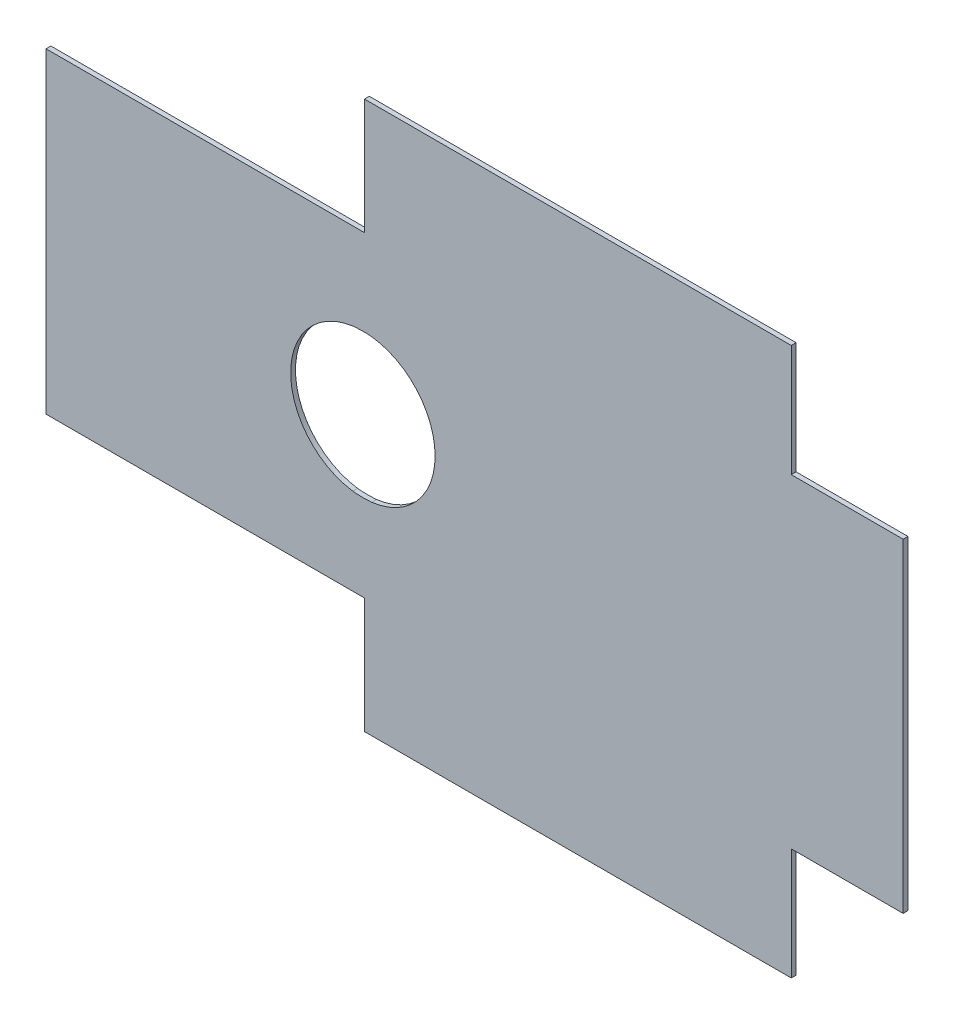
ISO-10303-21;
HEADER;
FILE_DESCRIPTION(('STEP AP214'),'2;1');
FILE_NAME('part.step','',(''),(''),'','','');
FILE_SCHEMA(('AUTOMOTIVE_DESIGN { 1 0 10303 214 1 1 1 1 }'));
ENDSEC;
DATA;
#1=APPLICATION_CONTEXT('core data for automotive mechanical design processes');
#2=APPLICATION_PROTOCOL_DEFINITION('international standard','automotive_design',2000,#1);
#3=PRODUCT_CONTEXT('',#1,'mechanical');
#4=PRODUCT('Part','Part','',(#3));
#5=PRODUCT_RELATED_PRODUCT_CATEGORY('part','',(#4));
#6=PRODUCT_DEFINITION_FORMATION('','',#4);
#7=PRODUCT_DEFINITION_CONTEXT('part definition',#1,'design');
#8=PRODUCT_DEFINITION('design','',#6,#7);
#9=PRODUCT_DEFINITION_SHAPE('','',#8);
#10=(LENGTH_UNIT() NAMED_UNIT(*) SI_UNIT(.MILLI.,.METRE.));
#11=(NAMED_UNIT(*) PLANE_ANGLE_UNIT() SI_UNIT($,.RADIAN.));
#12=(NAMED_UNIT(*) SI_UNIT($,.STERADIAN.) SOLID_ANGLE_UNIT());
#13=UNCERTAINTY_MEASURE_WITH_UNIT(LENGTH_MEASURE(1.E-05),#10,'distance_accuracy_value','');
#14=(GEOMETRIC_REPRESENTATION_CONTEXT(3) GLOBAL_UNCERTAINTY_ASSIGNED_CONTEXT((#13)) GLOBAL_UNIT_ASSIGNED_CONTEXT((#10,
#11,#12)) REPRESENTATION_CONTEXT('',''));
#15=CARTESIAN_POINT('',(0.,0.,0.));
#16=DIRECTION('',(0.,0.,1.));
#17=DIRECTION('',(1.,0.,0.));
#18=AXIS2_PLACEMENT_3D('',#15,#16,#17);
#19=CARTESIAN_POINT('',(-43.1719319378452,32.8600250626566,-1.00000000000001));
#20=DIRECTION('',(0.,1.,0.));
#21=DIRECTION('',(0.,0.,1.));
#22=AXIS2_PLACEMENT_3D('',#19,#20,#21);
#23=PLANE('',#22);
#24=DIRECTION('',(-1.,0.,0.));
#25=VECTOR('',#24,1.);
#26=CARTESIAN_POINT('',(-44.6719319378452,32.8600250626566,-1.00000000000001));
#27=LINE('',#26,#25);
#28=CARTESIAN_POINT('',(-43.1719319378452,32.8600250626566,-1.00000000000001));
#29=VERTEX_POINT('',#28);
#30=CARTESIAN_POINT('',(-44.6719319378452,32.8600250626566,-1.00000000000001));
#31=VERTEX_POINT('',#30);
#32=EDGE_CURVE('E458',#29,#31,#27,.T.);
#33=ORIENTED_EDGE('',*,*,#32,.F.);
#34=DIRECTION('',(0.,0.,-1.));
#35=VECTOR('',#34,1.);
#36=CARTESIAN_POINT('',(-43.1719319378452,32.8600250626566,0.));
#37=LINE('',#36,#35);
#38=CARTESIAN_POINT('',(-43.1719319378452,32.8600250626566,0.));
#39=VERTEX_POINT('',#38);
#40=EDGE_CURVE('E482',#39,#29,#37,.T.);
#41=ORIENTED_EDGE('',*,*,#40,.F.);
#42=DIRECTION('',(1.,0.,0.));
#43=VECTOR('',#42,1.);
#44=CARTESIAN_POINT('',(-44.6719319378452,32.8600250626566,0.));
#45=LINE('',#44,#43);
#46=CARTESIAN_POINT('',(-44.6719319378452,32.8600250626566,0.));
#47=VERTEX_POINT('',#46);
#48=EDGE_CURVE('E13',#47,#39,#45,.T.);
#49=ORIENTED_EDGE('',*,*,#48,.F.);
#50=DIRECTION('',(0.,0.,-1.));
#51=VECTOR('',#50,1.);
#52=CARTESIAN_POINT('',(-44.6719319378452,32.8600250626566,-1.00000000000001));
#53=LINE('',#52,#51);
#54=EDGE_CURVE('E198',#47,#31,#53,.T.);
#55=ORIENTED_EDGE('',*,*,#54,.T.);
#56=EDGE_LOOP('',(#33,#41,#49,#55));
#57=FACE_BOUND('',#56,.T.);
#58=ADVANCED_FACE('F190',(#57),#23,.F.);
#59=CARTESIAN_POINT('',(-43.1719319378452,-32.8600250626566,-1.));
#60=DIRECTION('',(0.,1.,0.));
#61=DIRECTION('',(0.,0.,1.));
#62=AXIS2_PLACEMENT_3D('',#59,#60,#61);
#63=PLANE('',#62);
#64=DIRECTION('',(0.,0.,-1.));
#65=VECTOR('',#64,1.);
#66=CARTESIAN_POINT('',(-44.6719319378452,-32.8600250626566,-1.));
#67=LINE('',#66,#65);
#68=CARTESIAN_POINT('',(-44.6719319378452,-32.8600250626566,0.));
#69=VERTEX_POINT('',#68);
#70=CARTESIAN_POINT('',(-44.6719319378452,-32.8600250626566,-1.));
#71=VERTEX_POINT('',#70);
#72=EDGE_CURVE('E209',#69,#71,#67,.T.);
#73=ORIENTED_EDGE('',*,*,#72,.F.);
#74=DIRECTION('',(1.,0.,0.));
#75=VECTOR('',#74,1.);
#76=CARTESIAN_POINT('',(-44.6719319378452,-32.8600250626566,0.));
#77=LINE('',#76,#75);
#78=CARTESIAN_POINT('',(-43.1719319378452,-32.8600250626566,0.));
#79=VERTEX_POINT('',#78);
#80=EDGE_CURVE('E485',#69,#79,#77,.T.);
#81=ORIENTED_EDGE('',*,*,#80,.T.);
#82=DIRECTION('',(0.,0.,-1.));
#83=VECTOR('',#82,1.);
#84=CARTESIAN_POINT('',(-43.1719319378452,-32.8600250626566,0.));
#85=LINE('',#84,#83);
#86=CARTESIAN_POINT('',(-43.1719319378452,-32.8600250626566,-0.999999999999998));
#87=VERTEX_POINT('',#86);
#88=EDGE_CURVE('E493',#79,#87,#85,.T.);
#89=ORIENTED_EDGE('',*,*,#88,.T.);
#90=DIRECTION('',(1.,0.,0.));
#91=VECTOR('',#90,1.);
#92=CARTESIAN_POINT('',(43.1719319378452,-32.8600250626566,-0.999999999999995));
#93=LINE('',#92,#91);
#94=EDGE_CURVE('E205',#71,#87,#93,.T.);
#95=ORIENTED_EDGE('',*,*,#94,.F.);
#96=EDGE_LOOP('',(#73,#81,#89,#95));
#97=FACE_BOUND('',#96,.T.);
#98=ADVANCED_FACE('F577',(#97),#63,.T.);
#99=CARTESIAN_POINT('',(44.6719319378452,34.3600250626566,-1.));
#100=DIRECTION('',(0.,0.,-1.));
#101=DIRECTION('',(-1.,0.,0.));
#102=AXIS2_PLACEMENT_3D('',#99,#100,#101);
#103=PLANE('',#102);
#104=CARTESIAN_POINT('',(-45.,0.,-1.00000000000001));
#105=DIRECTION('',(0.,0.,1.));
#106=DIRECTION('',(1.,0.,0.));
#107=AXIS2_PLACEMENT_3D('',#104,#105,#106);
#108=CIRCLE('',#107,15.);
#109=CARTESIAN_POINT('',(-47.0989227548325,14.8524248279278,-1.00000000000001));
#110=VERTEX_POINT('',#109);
#111=CARTESIAN_POINT('',(-47.0989227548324,-14.8524248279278,-1.00000000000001));
#112=VERTEX_POINT('',#111);
#113=EDGE_CURVE('E591',#110,#112,#108,.T.);
#114=ORIENTED_EDGE('',*,*,#113,.T.);
#115=CARTESIAN_POINT('',(-43.1719319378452,-14.8881888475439,-1.));
#116=CARTESIAN_POINT('',(-44.984497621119,-15.0503119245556,-1.));
#117=CARTESIAN_POINT('',(-47.0989227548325,-14.8524248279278,-1.));
#118=B_SPLINE_CURVE_WITH_KNOTS('',2,(#115,#116,#117),.UNSPECIFIED.,.F.,.F.,(3,3),(0.,1.),.UNSPECIFIED.);
#119=CARTESIAN_POINT('',(-43.1719319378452,-14.8881888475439,-1.));
#120=VERTEX_POINT('',#119);
#121=EDGE_CURVE('E443',#120,#112,#118,.T.);
#122=ORIENTED_EDGE('',*,*,#121,.F.);
#123=CARTESIAN_POINT('',(-45.,0.,-1.));
#124=DIRECTION('',(0.,0.,1.));
#125=DIRECTION('',(1.,0.,0.));
#126=AXIS2_PLACEMENT_3D('',#123,#124,#125);
#127=CIRCLE('',#126,15.);
#128=CARTESIAN_POINT('',(-43.1719319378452,14.8881888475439,-1.));
#129=VERTEX_POINT('',#128);
#130=EDGE_CURVE('E557',#120,#129,#127,.T.);
#131=ORIENTED_EDGE('',*,*,#130,.T.);
#132=CARTESIAN_POINT('',(-47.0989227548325,14.8524248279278,-1.00000000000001));
#133=CARTESIAN_POINT('',(-45.2797906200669,15.0474018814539,-1.00000000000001));
#134=CARTESIAN_POINT('',(-43.1719319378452,14.8881888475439,-1.00000000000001));
#135=B_SPLINE_CURVE_WITH_KNOTS('',2,(#132,#133,#134),.UNSPECIFIED.,.F.,.F.,(3,3),(0.,1.),.UNSPECIFIED.);
#136=EDGE_CURVE('E479',#110,#129,#135,.T.);
#137=ORIENTED_EDGE('',*,*,#136,.F.);
#138=EDGE_LOOP('',(#114,#122,#131,#137));
#139=FACE_BOUND('',#138,.T.);
#140=DIRECTION('',(-1.,0.,0.));
#141=VECTOR('',#140,1.);
#142=CARTESIAN_POINT('',(-45.1354273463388,-32.8600250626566,-1.));
#143=LINE('',#142,#141);
#144=CARTESIAN_POINT('',(-110.798922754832,-32.8600250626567,-1.00000000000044));
#145=VERTEX_POINT('',#144);
#146=EDGE_CURVE('E448',#145,#87,#143,.F.);
#147=ORIENTED_EDGE('',*,*,#146,.F.);
#148=DIRECTION('',(0.,1.,0.));
#149=VECTOR('',#148,1.);
#150=CARTESIAN_POINT('',(-110.798922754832,32.8600250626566,-1.00000000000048));
#151=LINE('',#150,#149);
#152=CARTESIAN_POINT('',(-110.798922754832,32.8600250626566,-1.00000000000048));
#153=VERTEX_POINT('',#152);
#154=EDGE_CURVE('E475',#145,#153,#151,.T.);
#155=ORIENTED_EDGE('',*,*,#154,.T.);
#156=DIRECTION('',(-1.,0.,0.));
#157=VECTOR('',#156,1.);
#158=CARTESIAN_POINT('',(-45.1354273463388,32.8600250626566,-1.00000000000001));
#159=LINE('',#158,#157);
#160=EDGE_CURVE('E472',#29,#153,#159,.T.);
#161=ORIENTED_EDGE('',*,*,#160,.F.);
#162=ORIENTED_EDGE('',*,*,#32,.T.);
#163=DIRECTION('',(0.,1.,0.));
#164=VECTOR('',#163,1.);
#165=CARTESIAN_POINT('',(-44.6719319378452,34.8235204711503,-1.00000000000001));
#166=LINE('',#165,#164);
#167=CARTESIAN_POINT('',(-44.6719319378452,56.8870158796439,-1.00000000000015));
#168=VERTEX_POINT('',#167);
#169=EDGE_CURVE('E358',#168,#31,#166,.F.);
#170=ORIENTED_EDGE('',*,*,#169,.F.);
#171=DIRECTION('',(1.,0.,0.));
#172=VECTOR('',#171,1.);
#173=CARTESIAN_POINT('',(44.6719319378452,56.8870158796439,-1.00000000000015));
#174=LINE('',#173,#172);
#175=CARTESIAN_POINT('',(43.9648251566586,56.8870158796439,-1.00000000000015));
#176=VERTEX_POINT('',#175);
#177=EDGE_CURVE('E325',#168,#176,#174,.T.);
#178=ORIENTED_EDGE('',*,*,#177,.T.);
#179=DIRECTION('',(0.,1.,0.));
#180=VECTOR('',#179,1.);
#181=CARTESIAN_POINT('',(43.9648251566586,56.8870158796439,-1.00000000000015));
#182=LINE('',#181,#180);
#183=CARTESIAN_POINT('',(43.9648251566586,33.6529182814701,-0.99999999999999));
#184=VERTEX_POINT('',#183);
#185=EDGE_CURVE('E324',#184,#176,#182,.T.);
#186=ORIENTED_EDGE('',*,*,#185,.F.);
#187=DIRECTION('',(1.,0.,0.));
#188=VECTOR('',#187,1.);
#189=CARTESIAN_POINT('',(67.1989227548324,33.6529182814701,-1.00000000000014));
#190=LINE('',#189,#188);
#191=CARTESIAN_POINT('',(67.1989227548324,33.6529182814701,-1.00000000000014));
#192=VERTEX_POINT('',#191);
#193=EDGE_CURVE('E342',#184,#192,#190,.T.);
#194=ORIENTED_EDGE('',*,*,#193,.T.);
#195=DIRECTION('',(0.,-1.,0.));
#196=VECTOR('',#195,1.);
#197=CARTESIAN_POINT('',(67.1989227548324,-34.3600250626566,-1.00000000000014));
#198=LINE('',#197,#196);
#199=CARTESIAN_POINT('',(67.1989227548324,-33.6529182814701,-1.00000000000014));
#200=VERTEX_POINT('',#199);
#201=EDGE_CURVE('E338',#192,#200,#198,.T.);
#202=ORIENTED_EDGE('',*,*,#201,.T.);
#203=DIRECTION('',(1.,0.,0.));
#204=VECTOR('',#203,1.);
#205=CARTESIAN_POINT('',(67.1989227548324,-33.6529182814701,-1.00000000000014));
#206=LINE('',#205,#204);
#207=CARTESIAN_POINT('',(43.9648251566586,-33.6529182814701,-0.999999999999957));
#208=VERTEX_POINT('',#207);
#209=EDGE_CURVE('E368',#208,#200,#206,.T.);
#210=ORIENTED_EDGE('',*,*,#209,.F.);
#211=DIRECTION('',(0.,-1.,0.));
#212=VECTOR('',#211,1.);
#213=CARTESIAN_POINT('',(43.9648251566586,-56.8870158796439,-1.00000000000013));
#214=LINE('',#213,#212);
#215=CARTESIAN_POINT('',(43.9648251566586,-56.8870158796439,-1.00000000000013));
#216=VERTEX_POINT('',#215);
#217=EDGE_CURVE('E388',#208,#216,#214,.T.);
#218=ORIENTED_EDGE('',*,*,#217,.T.);
#219=DIRECTION('',(-1.,0.,0.));
#220=VECTOR('',#219,1.);
#221=CARTESIAN_POINT('',(-44.6719319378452,-56.8870158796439,-1.00000000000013));
#222=LINE('',#221,#220);
#223=CARTESIAN_POINT('',(-44.6719319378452,-56.8870158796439,-1.00000000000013));
#224=VERTEX_POINT('',#223);
#225=EDGE_CURVE('E385',#216,#224,#222,.T.);
#226=ORIENTED_EDGE('',*,*,#225,.T.);
#227=DIRECTION('',(0.,1.,0.));
#228=VECTOR('',#227,1.);
#229=CARTESIAN_POINT('',(-44.6719319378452,-34.8235204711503,-0.999999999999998));
#230=LINE('',#229,#228);
#231=EDGE_CURVE('E394',#71,#224,#230,.F.);
#232=ORIENTED_EDGE('',*,*,#231,.F.);
#233=ORIENTED_EDGE('',*,*,#94,.T.);
#234=EDGE_LOOP('',(#147,#155,#161,#162,#170,#178,#186,#194,#202,#210,#218,#226,#232,#233));
#235=FACE_BOUND('',#234,.T.);
#236=ADVANCED_FACE('F192',(#139,#235),#103,.T.);
#237=CARTESIAN_POINT('',(44.6719319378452,34.3600250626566,0.));
#238=DIRECTION('',(0.,0.,-1.));
#239=DIRECTION('',(-1.,0.,0.));
#240=AXIS2_PLACEMENT_3D('',#237,#238,#239);
#241=PLANE('',#240);
#242=DIRECTION('',(0.,1.,0.));
#243=VECTOR('',#242,1.);
#244=CARTESIAN_POINT('',(-110.798922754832,32.8600250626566,-4.78783679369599E-13));
#245=LINE('',#244,#243);
#246=CARTESIAN_POINT('',(-110.798922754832,-32.8600250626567,-4.44089209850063E-13));
#247=VERTEX_POINT('',#246);
#248=CARTESIAN_POINT('',(-110.798922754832,32.8600250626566,-4.78783679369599E-13));
#249=VERTEX_POINT('',#248);
#250=EDGE_CURVE('E878',#247,#249,#245,.T.);
#251=ORIENTED_EDGE('',*,*,#250,.F.);
#252=DIRECTION('',(-1.,0.,0.));
#253=VECTOR('',#252,1.);
#254=CARTESIAN_POINT('',(-45.1354273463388,-32.8600250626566,0.));
#255=LINE('',#254,#253);
#256=EDGE_CURVE('E449',#247,#79,#255,.F.);
#257=ORIENTED_EDGE('',*,*,#256,.T.);
#258=ORIENTED_EDGE('',*,*,#80,.F.);
#259=DIRECTION('',(0.,1.,0.));
#260=VECTOR('',#259,1.);
#261=CARTESIAN_POINT('',(-44.6719319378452,-34.8235204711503,0.));
#262=LINE('',#261,#260);
#263=CARTESIAN_POINT('',(-44.6719319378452,-56.8870158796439,-1.31838984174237E-13));
#264=VERTEX_POINT('',#263);
#265=EDGE_CURVE('E381',#69,#264,#262,.F.);
#266=ORIENTED_EDGE('',*,*,#265,.T.);
#267=DIRECTION('',(-1.,0.,0.));
#268=VECTOR('',#267,1.);
#269=CARTESIAN_POINT('',(-44.6719319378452,-56.8870158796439,-1.31838984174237E-13));
#270=LINE('',#269,#268);
#271=CARTESIAN_POINT('',(43.9648251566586,-56.8870158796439,-1.31838984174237E-13));
#272=VERTEX_POINT('',#271);
#273=EDGE_CURVE('E390',#272,#264,#270,.T.);
#274=ORIENTED_EDGE('',*,*,#273,.F.);
#275=DIRECTION('',(0.,-1.,0.));
#276=VECTOR('',#275,1.);
#277=CARTESIAN_POINT('',(43.9648251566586,-35.2870158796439,0.));
#278=LINE('',#277,#276);
#279=CARTESIAN_POINT('',(43.9648251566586,-33.6529182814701,0.));
#280=VERTEX_POINT('',#279);
#281=EDGE_CURVE('E382',#280,#272,#278,.T.);
#282=ORIENTED_EDGE('',*,*,#281,.F.);
#283=DIRECTION('',(1.,0.,0.));
#284=VECTOR('',#283,1.);
#285=CARTESIAN_POINT('',(45.5989227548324,-33.6529182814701,0.));
#286=LINE('',#285,#284);
#287=CARTESIAN_POINT('',(67.1989227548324,-33.6529182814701,0.));
#288=VERTEX_POINT('',#287);
#289=EDGE_CURVE('E337',#280,#288,#286,.T.);
#290=ORIENTED_EDGE('',*,*,#289,.T.);
#291=DIRECTION('',(0.,-1.,0.));
#292=VECTOR('',#291,1.);
#293=CARTESIAN_POINT('',(67.1989227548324,-34.3600250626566,-1.38777878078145E-13));
#294=LINE('',#293,#292);
#295=CARTESIAN_POINT('',(67.1989227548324,33.6529182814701,-1.38777878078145E-13));
#296=VERTEX_POINT('',#295);
#297=EDGE_CURVE('E334',#296,#288,#294,.T.);
#298=ORIENTED_EDGE('',*,*,#297,.F.);
#299=DIRECTION('',(1.,0.,0.));
#300=VECTOR('',#299,1.);
#301=CARTESIAN_POINT('',(45.5989227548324,33.6529182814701,0.));
#302=LINE('',#301,#300);
#303=CARTESIAN_POINT('',(43.9648251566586,33.6529182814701,0.));
#304=VERTEX_POINT('',#303);
#305=EDGE_CURVE('E329',#304,#296,#302,.T.);
#306=ORIENTED_EDGE('',*,*,#305,.F.);
#307=DIRECTION('',(0.,1.,0.));
#308=VECTOR('',#307,1.);
#309=CARTESIAN_POINT('',(43.9648251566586,35.2870158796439,0.));
#310=LINE('',#309,#308);
#311=CARTESIAN_POINT('',(43.9648251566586,56.8870158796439,0.));
#312=VERTEX_POINT('',#311);
#313=EDGE_CURVE('E314',#304,#312,#310,.T.);
#314=ORIENTED_EDGE('',*,*,#313,.T.);
#315=DIRECTION('',(1.,0.,0.));
#316=VECTOR('',#315,1.);
#317=CARTESIAN_POINT('',(44.6719319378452,56.8870158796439,-1.52655665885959E-13));
#318=LINE('',#317,#316);
#319=CARTESIAN_POINT('',(-44.6719319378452,56.8870158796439,-1.52655665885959E-13));
#320=VERTEX_POINT('',#319);
#321=EDGE_CURVE('E354',#320,#312,#318,.T.);
#322=ORIENTED_EDGE('',*,*,#321,.F.);
#323=DIRECTION('',(0.,1.,0.));
#324=VECTOR('',#323,1.);
#325=CARTESIAN_POINT('',(-44.6719319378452,34.8235204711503,0.));
#326=LINE('',#325,#324);
#327=EDGE_CURVE('E350',#320,#47,#326,.F.);
#328=ORIENTED_EDGE('',*,*,#327,.T.);
#329=ORIENTED_EDGE('',*,*,#48,.T.);
#330=DIRECTION('',(-1.,0.,0.));
#331=VECTOR('',#330,1.);
#332=CARTESIAN_POINT('',(-45.1354273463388,32.8600250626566,0.));
#333=LINE('',#332,#331);
#334=EDGE_CURVE('E484',#39,#249,#333,.T.);
#335=ORIENTED_EDGE('',*,*,#334,.T.);
#336=EDGE_LOOP('',(#251,#257,#258,#266,#274,#282,#290,#298,#306,#314,#322,#328,#329,#335));
#337=FACE_BOUND('',#336,.T.);
#338=CARTESIAN_POINT('',(-43.1719319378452,-14.8881888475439,0.));
#339=CARTESIAN_POINT('',(-44.984497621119,-15.0503119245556,0.));
#340=CARTESIAN_POINT('',(-47.0989227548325,-14.8524248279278,0.));
#341=B_SPLINE_CURVE_WITH_KNOTS('',2,(#338,#339,#340),.UNSPECIFIED.,.F.,.F.,(3,3),(0.,1.),.UNSPECIFIED.);
#342=CARTESIAN_POINT('',(-43.1719319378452,-14.8881888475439,0.));
#343=VERTEX_POINT('',#342);
#344=CARTESIAN_POINT('',(-47.0989227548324,-14.8524248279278,0.));
#345=VERTEX_POINT('',#344);
#346=EDGE_CURVE('E453',#343,#345,#341,.T.);
#347=ORIENTED_EDGE('',*,*,#346,.T.);
#348=CARTESIAN_POINT('',(-45.,0.,0.));
#349=DIRECTION('',(0.,0.,1.));
#350=DIRECTION('',(1.,0.,0.));
#351=AXIS2_PLACEMENT_3D('',#348,#349,#350);
#352=CIRCLE('',#351,15.);
#353=CARTESIAN_POINT('',(-47.0989227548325,14.8524248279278,0.));
#354=VERTEX_POINT('',#353);
#355=EDGE_CURVE('E595',#354,#345,#352,.T.);
#356=ORIENTED_EDGE('',*,*,#355,.F.);
#357=CARTESIAN_POINT('',(-47.0989227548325,14.8524248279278,0.));
#358=CARTESIAN_POINT('',(-45.2797906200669,15.0474018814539,0.));
#359=CARTESIAN_POINT('',(-43.1719319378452,14.8881888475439,0.));
#360=B_SPLINE_CURVE_WITH_KNOTS('',2,(#357,#358,#359),.UNSPECIFIED.,.F.,.F.,(3,3),(0.,1.),.UNSPECIFIED.);
#361=CARTESIAN_POINT('',(-43.1719319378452,14.8881888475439,0.));
#362=VERTEX_POINT('',#361);
#363=EDGE_CURVE('E450',#354,#362,#360,.T.);
#364=ORIENTED_EDGE('',*,*,#363,.T.);
#365=CARTESIAN_POINT('',(-45.,0.,0.));
#366=DIRECTION('',(0.,0.,1.));
#367=DIRECTION('',(1.,0.,0.));
#368=AXIS2_PLACEMENT_3D('',#365,#366,#367);
#369=CIRCLE('',#368,15.);
#370=EDGE_CURVE('E500',#343,#362,#369,.T.);
#371=ORIENTED_EDGE('',*,*,#370,.F.);
#372=EDGE_LOOP('',(#347,#356,#364,#371));
#373=FACE_BOUND('',#372,.T.);
#374=ADVANCED_FACE('F331',(#337,#373),#241,.F.);
#375=CARTESIAN_POINT('',(-45.,0.,-1.));
#376=DIRECTION('',(0.,0.,1.));
#377=DIRECTION('',(1.,0.,0.));
#378=AXIS2_PLACEMENT_3D('',#375,#376,#377);
#379=CYLINDRICAL_SURFACE('',#378,15.);
#380=CARTESIAN_POINT('',(-43.1719319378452,-14.8881888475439,0.));
#381=CARTESIAN_POINT('',(-43.1719319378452,-14.8881888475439,-1.));
#382=B_SPLINE_CURVE_WITH_KNOTS('',1,(#380,#381),.UNSPECIFIED.,.F.,.F.,(2,2),(0.,1.),.UNSPECIFIED.);
#383=EDGE_CURVE('E490',#343,#120,#382,.T.);
#384=ORIENTED_EDGE('',*,*,#383,.F.);
#385=ORIENTED_EDGE('',*,*,#370,.T.);
#386=DIRECTION('',(0.,0.,1.));
#387=VECTOR('',#386,1.);
#388=CARTESIAN_POINT('',(-43.1719319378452,14.8881888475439,-1.));
#389=LINE('',#388,#387);
#390=EDGE_CURVE('E486',#129,#362,#389,.T.);
#391=ORIENTED_EDGE('',*,*,#390,.F.);
#392=ORIENTED_EDGE('',*,*,#130,.F.);
#393=EDGE_LOOP('',(#384,#385,#391,#392));
#394=FACE_BOUND('',#393,.T.);
#395=ADVANCED_FACE('F568',(#394),#379,.F.);
#396=CARTESIAN_POINT('',(-45.1354273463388,32.8600250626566,0.));
#397=DIRECTION('',(0.,-1.,0.));
#398=DIRECTION('',(-1.,0.,0.));
#399=AXIS2_PLACEMENT_3D('',#396,#397,#398);
#400=PLANE('',#399);
#401=ORIENTED_EDGE('',*,*,#160,.T.);
#402=DIRECTION('',(0.,0.,1.));
#403=VECTOR('',#402,1.);
#404=CARTESIAN_POINT('',(-110.798922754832,32.8600250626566,-1.00000000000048));
#405=LINE('',#404,#403);
#406=EDGE_CURVE('E408',#153,#249,#405,.T.);
#407=ORIENTED_EDGE('',*,*,#406,.T.);
#408=ORIENTED_EDGE('',*,*,#334,.F.);
#409=ORIENTED_EDGE('',*,*,#40,.T.);
#410=EDGE_LOOP('',(#401,#407,#408,#409));
#411=FACE_BOUND('',#410,.T.);
#412=ADVANCED_FACE('F483',(#411),#400,.F.);
#413=CARTESIAN_POINT('',(-47.0989227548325,14.8524248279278,-1.00000000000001));
#414=CARTESIAN_POINT('',(-45.8861679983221,14.9824095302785,-1.00000000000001));
#415=CARTESIAN_POINT('',(-44.5771710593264,14.9943308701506,-1.00000000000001));
#416=CARTESIAN_POINT('',(-43.1719319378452,14.8881888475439,-1.00000000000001));
#417=CARTESIAN_POINT('',(-47.0989227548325,14.8524248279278,0.));
#418=CARTESIAN_POINT('',(-45.8861679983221,14.9824095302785,0.));
#419=CARTESIAN_POINT('',(-44.5771710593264,14.9943308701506,0.));
#420=CARTESIAN_POINT('',(-43.1719319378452,14.8881888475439,0.));
#421=B_SPLINE_SURFACE_WITH_KNOTS('',1,3,((#413,#414,#415,#416),(#417,#418,#419,#420)),
.UNSPECIFIED.,.F.,.F.,.F.,(2,2),(4,4),(0.,1.),(0.,1.),.UNSPECIFIED.);
#422=CARTESIAN_POINT('',(-47.0989227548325,14.8524248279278,0.));
#423=CARTESIAN_POINT('',(-47.0989227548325,14.8524248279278,-1.00000000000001));
#424=B_SPLINE_CURVE_WITH_KNOTS('',1,(#422,#423),.UNSPECIFIED.,.F.,.F.,(2,2),(0.,1.),.UNSPECIFIED.);
#425=EDGE_CURVE('E402',#354,#110,#424,.T.);
#426=ORIENTED_EDGE('',*,*,#390,.T.);
#427=ORIENTED_EDGE('',*,*,#363,.F.);
#428=ORIENTED_EDGE('',*,*,#425,.T.);
#429=ORIENTED_EDGE('',*,*,#136,.T.);
#430=EDGE_LOOP('',(#426,#427,#428,#429));
#431=FACE_BOUND('',#430,.T.);
#432=ADVANCED_FACE('F521',(#431),#421,.F.);
#433=CARTESIAN_POINT('',(-43.1719319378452,-14.8881888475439,-1.));
#434=CARTESIAN_POINT('',(-44.3803090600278,-14.996270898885,-1.));
#435=CARTESIAN_POINT('',(-45.6893059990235,-14.984349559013,-1.));
#436=CARTESIAN_POINT('',(-47.0989227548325,-14.8524248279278,-1.));
#437=CARTESIAN_POINT('',(-43.1719319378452,-14.8881888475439,0.));
#438=CARTESIAN_POINT('',(-44.3803090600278,-14.996270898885,0.));
#439=CARTESIAN_POINT('',(-45.6893059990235,-14.984349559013,0.));
#440=CARTESIAN_POINT('',(-47.0989227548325,-14.8524248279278,0.));
#441=B_SPLINE_SURFACE_WITH_KNOTS('',1,3,((#433,#434,#435,#436),(#437,#438,#439,#440)),
.UNSPECIFIED.,.F.,.F.,.F.,(2,2),(4,4),(0.,1.),(0.,1.),.UNSPECIFIED.);
#442=DIRECTION('',(0.,0.,1.));
#443=VECTOR('',#442,1.);
#444=CARTESIAN_POINT('',(-47.0989227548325,-14.8524248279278,-1.));
#445=LINE('',#444,#443);
#446=EDGE_CURVE('E396',#112,#345,#445,.T.);
#447=ORIENTED_EDGE('',*,*,#446,.T.);
#448=ORIENTED_EDGE('',*,*,#346,.F.);
#449=ORIENTED_EDGE('',*,*,#383,.T.);
#450=ORIENTED_EDGE('',*,*,#121,.T.);
#451=EDGE_LOOP('',(#447,#448,#449,#450));
#452=FACE_BOUND('',#451,.T.);
#453=ADVANCED_FACE('F515',(#452),#441,.F.);
#454=CARTESIAN_POINT('',(-45.1354273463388,-32.8600250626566,0.));
#455=DIRECTION('',(0.,-1.,0.));
#456=DIRECTION('',(-1.,0.,0.));
#457=AXIS2_PLACEMENT_3D('',#454,#455,#456);
#458=PLANE('',#457);
#459=ORIENTED_EDGE('',*,*,#88,.F.);
#460=ORIENTED_EDGE('',*,*,#256,.F.);
#461=DIRECTION('',(0.,0.,1.));
#462=VECTOR('',#461,1.);
#463=CARTESIAN_POINT('',(-110.798922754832,-32.8600250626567,-1.00000000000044));
#464=LINE('',#463,#462);
#465=EDGE_CURVE('E593',#145,#247,#464,.T.);
#466=ORIENTED_EDGE('',*,*,#465,.F.);
#467=ORIENTED_EDGE('',*,*,#146,.T.);
#468=EDGE_LOOP('',(#459,#460,#466,#467));
#469=FACE_BOUND('',#468,.T.);
#470=ADVANCED_FACE('F642',(#469),#458,.T.);
#471=CARTESIAN_POINT('',(-110.798922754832,32.8600250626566,-1.00000000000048));
#472=DIRECTION('',(1.,0.,0.));
#473=DIRECTION('',(0.,0.,-1.));
#474=AXIS2_PLACEMENT_3D('',#471,#472,#473);
#475=PLANE('',#474);
#476=ORIENTED_EDGE('',*,*,#250,.T.);
#477=ORIENTED_EDGE('',*,*,#406,.F.);
#478=ORIENTED_EDGE('',*,*,#154,.F.);
#479=ORIENTED_EDGE('',*,*,#465,.T.);
#480=EDGE_LOOP('',(#476,#477,#478,#479));
#481=FACE_BOUND('',#480,.T.);
#482=ADVANCED_FACE('F421',(#481),#475,.F.);
#483=CARTESIAN_POINT('',(-45.,0.,-1.00000000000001));
#484=DIRECTION('',(0.,0.,1.));
#485=DIRECTION('',(1.,0.,0.));
#486=AXIS2_PLACEMENT_3D('',#483,#484,#485);
#487=CYLINDRICAL_SURFACE('',#486,15.);
#488=ORIENTED_EDGE('',*,*,#446,.F.);
#489=ORIENTED_EDGE('',*,*,#113,.F.);
#490=ORIENTED_EDGE('',*,*,#425,.F.);
#491=ORIENTED_EDGE('',*,*,#355,.T.);
#492=EDGE_LOOP('',(#488,#489,#490,#491));
#493=FACE_BOUND('',#492,.T.);
#494=ADVANCED_FACE('F410',(#493),#487,.F.);
#495=CARTESIAN_POINT('',(-44.6719319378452,-34.8235204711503,0.));
#496=DIRECTION('',(-1.,0.,0.));
#497=DIRECTION('',(0.,1.,0.));
#498=AXIS2_PLACEMENT_3D('',#495,#496,#497);
#499=PLANE('',#498);
#500=ORIENTED_EDGE('',*,*,#231,.T.);
#501=DIRECTION('',(0.,0.,1.));
#502=VECTOR('',#501,1.);
#503=CARTESIAN_POINT('',(-44.6719319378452,-56.8870158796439,-1.00000000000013));
#504=LINE('',#503,#502);
#505=EDGE_CURVE('E378',#224,#264,#504,.T.);
#506=ORIENTED_EDGE('',*,*,#505,.T.);
#507=ORIENTED_EDGE('',*,*,#265,.F.);
#508=ORIENTED_EDGE('',*,*,#72,.T.);
#509=EDGE_LOOP('',(#500,#506,#507,#508));
#510=FACE_BOUND('',#509,.T.);
#511=ADVANCED_FACE('F420',(#510),#499,.T.);
#512=CARTESIAN_POINT('',(-44.6719319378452,-56.8870158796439,-1.00000000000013));
#513=DIRECTION('',(0.,1.,0.));
#514=DIRECTION('',(0.,0.,1.));
#515=AXIS2_PLACEMENT_3D('',#512,#513,#514);
#516=PLANE('',#515);
#517=ORIENTED_EDGE('',*,*,#225,.F.);
#518=DIRECTION('',(0.,0.,1.));
#519=VECTOR('',#518,1.);
#520=CARTESIAN_POINT('',(43.9648251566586,-56.8870158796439,-1.00000000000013));
#521=LINE('',#520,#519);
#522=EDGE_CURVE('E367',#216,#272,#521,.T.);
#523=ORIENTED_EDGE('',*,*,#522,.T.);
#524=ORIENTED_EDGE('',*,*,#273,.T.);
#525=ORIENTED_EDGE('',*,*,#505,.F.);
#526=EDGE_LOOP('',(#517,#523,#524,#525));
#527=FACE_BOUND('',#526,.T.);
#528=ADVANCED_FACE('F608',(#527),#516,.F.);
#529=CARTESIAN_POINT('',(43.9648251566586,-35.2870158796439,0.));
#530=DIRECTION('',(-1.,0.,0.));
#531=DIRECTION('',(0.,-1.,0.));
#532=AXIS2_PLACEMENT_3D('',#529,#530,#531);
#533=PLANE('',#532);
#534=ORIENTED_EDGE('',*,*,#522,.F.);
#535=ORIENTED_EDGE('',*,*,#217,.F.);
#536=DIRECTION('',(0.,0.,-1.));
#537=VECTOR('',#536,1.);
#538=CARTESIAN_POINT('',(43.9648251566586,-33.6529182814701,0.));
#539=LINE('',#538,#537);
#540=EDGE_CURVE('E343',#280,#208,#539,.T.);
#541=ORIENTED_EDGE('',*,*,#540,.F.);
#542=ORIENTED_EDGE('',*,*,#281,.T.);
#543=EDGE_LOOP('',(#534,#535,#541,#542));
#544=FACE_BOUND('',#543,.T.);
#545=ADVANCED_FACE('F612',(#544),#533,.F.);
#546=CARTESIAN_POINT('',(67.1989227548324,-34.3600250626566,-1.00000000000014));
#547=DIRECTION('',(-1.,0.,0.));
#548=DIRECTION('',(0.,0.,1.));
#549=AXIS2_PLACEMENT_3D('',#546,#547,#548);
#550=PLANE('',#549);
#551=ORIENTED_EDGE('',*,*,#201,.F.);
#552=DIRECTION('',(0.,0.,1.));
#553=VECTOR('',#552,1.);
#554=CARTESIAN_POINT('',(67.1989227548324,33.6529182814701,-1.00000000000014));
#555=LINE('',#554,#553);
#556=EDGE_CURVE('E361',#192,#296,#555,.T.);
#557=ORIENTED_EDGE('',*,*,#556,.T.);
#558=ORIENTED_EDGE('',*,*,#297,.T.);
#559=DIRECTION('',(0.,0.,1.));
#560=VECTOR('',#559,1.);
#561=CARTESIAN_POINT('',(67.1989227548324,-33.6529182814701,-1.00000000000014));
#562=LINE('',#561,#560);
#563=EDGE_CURVE('E364',#200,#288,#562,.T.);
#564=ORIENTED_EDGE('',*,*,#563,.F.);
#565=EDGE_LOOP('',(#551,#557,#558,#564));
#566=FACE_BOUND('',#565,.T.);
#567=ADVANCED_FACE('F619',(#566),#550,.F.);
#568=CARTESIAN_POINT('',(45.5989227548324,33.6529182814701,0.));
#569=DIRECTION('',(0.,-1.,0.));
#570=DIRECTION('',(-1.,0.,0.));
#571=AXIS2_PLACEMENT_3D('',#568,#569,#570);
#572=PLANE('',#571);
#573=ORIENTED_EDGE('',*,*,#556,.F.);
#574=ORIENTED_EDGE('',*,*,#193,.F.);
#575=DIRECTION('',(0.,0.,-1.));
#576=VECTOR('',#575,1.);
#577=CARTESIAN_POINT('',(43.9648251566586,33.6529182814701,0.));
#578=LINE('',#577,#576);
#579=EDGE_CURVE('E318',#304,#184,#578,.T.);
#580=ORIENTED_EDGE('',*,*,#579,.F.);
#581=ORIENTED_EDGE('',*,*,#305,.T.);
#582=EDGE_LOOP('',(#573,#574,#580,#581));
#583=FACE_BOUND('',#582,.T.);
#584=ADVANCED_FACE('F341',(#583),#572,.F.);
#585=CARTESIAN_POINT('',(45.5989227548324,-33.6529182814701,0.));
#586=DIRECTION('',(0.,-1.,0.));
#587=DIRECTION('',(-1.,0.,0.));
#588=AXIS2_PLACEMENT_3D('',#585,#586,#587);
#589=PLANE('',#588);
#590=ORIENTED_EDGE('',*,*,#209,.T.);
#591=ORIENTED_EDGE('',*,*,#563,.T.);
#592=ORIENTED_EDGE('',*,*,#289,.F.);
#593=ORIENTED_EDGE('',*,*,#540,.T.);
#594=EDGE_LOOP('',(#590,#591,#592,#593));
#595=FACE_BOUND('',#594,.T.);
#596=ADVANCED_FACE('F615',(#595),#589,.T.);
#597=CARTESIAN_POINT('',(-44.6719319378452,34.8235204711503,0.));
#598=DIRECTION('',(-1.,0.,0.));
#599=DIRECTION('',(0.,1.,0.));
#600=AXIS2_PLACEMENT_3D('',#597,#598,#599);
#601=PLANE('',#600);
#602=ORIENTED_EDGE('',*,*,#54,.F.);
#603=ORIENTED_EDGE('',*,*,#327,.F.);
#604=DIRECTION('',(0.,0.,1.));
#605=VECTOR('',#604,1.);
#606=CARTESIAN_POINT('',(-44.6719319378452,56.8870158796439,-1.00000000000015));
#607=LINE('',#606,#605);
#608=EDGE_CURVE('E346',#168,#320,#607,.T.);
#609=ORIENTED_EDGE('',*,*,#608,.F.);
#610=ORIENTED_EDGE('',*,*,#169,.T.);
#611=EDGE_LOOP('',(#602,#603,#609,#610));
#612=FACE_BOUND('',#611,.T.);
#613=ADVANCED_FACE('F465',(#612),#601,.T.);
#614=CARTESIAN_POINT('',(44.6719319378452,56.8870158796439,-1.00000000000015));
#615=DIRECTION('',(0.,-1.,0.));
#616=DIRECTION('',(0.,0.,-1.));
#617=AXIS2_PLACEMENT_3D('',#614,#615,#616);
#618=PLANE('',#617);
#619=DIRECTION('',(0.,0.,1.));
#620=VECTOR('',#619,1.);
#621=CARTESIAN_POINT('',(43.9648251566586,56.8870158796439,-1.00000000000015));
#622=LINE('',#621,#620);
#623=EDGE_CURVE('E320',#176,#312,#622,.T.);
#624=ORIENTED_EDGE('',*,*,#623,.F.);
#625=ORIENTED_EDGE('',*,*,#177,.F.);
#626=ORIENTED_EDGE('',*,*,#608,.T.);
#627=ORIENTED_EDGE('',*,*,#321,.T.);
#628=EDGE_LOOP('',(#624,#625,#626,#627));
#629=FACE_BOUND('',#628,.T.);
#630=ADVANCED_FACE('F468',(#629),#618,.F.);
#631=CARTESIAN_POINT('',(43.9648251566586,35.2870158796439,0.));
#632=DIRECTION('',(1.,0.,0.));
#633=DIRECTION('',(0.,-1.,0.));
#634=AXIS2_PLACEMENT_3D('',#631,#632,#633);
#635=PLANE('',#634);
#636=ORIENTED_EDGE('',*,*,#185,.T.);
#637=ORIENTED_EDGE('',*,*,#623,.T.);
#638=ORIENTED_EDGE('',*,*,#313,.F.);
#639=ORIENTED_EDGE('',*,*,#579,.T.);
#640=EDGE_LOOP('',(#636,#637,#638,#639));
#641=FACE_BOUND('',#640,.T.);
#642=ADVANCED_FACE('F316',(#641),#635,.T.);
#643=CLOSED_SHELL('',(#58,#98,#236,#374,#395,#412,#432,#453,#470,#482,#494,#511,#528,#545,#567,
#584,#596,#613,#630,#642));
#644=MANIFOLD_SOLID_BREP('B2',#643);
#645=ADVANCED_BREP_SHAPE_REPRESENTATION('',(#18,#644),#14);
#646=SHAPE_DEFINITION_REPRESENTATION(#9,#645);
ENDSEC;
END-ISO-10303-21;
